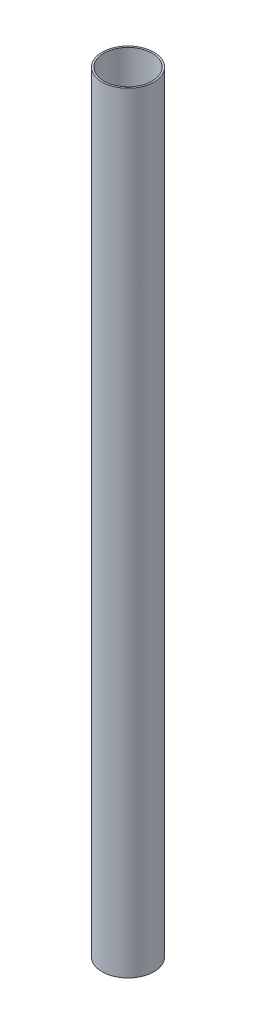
from build123d import *

# Parameters (mm, degrees)
BASE_EXTRUSION_DEPTH      = 870
BASE_EXTRUSION_DEPTH_BACK = 23
ESQUISSE1_R               = 30
ESQUISSE1_R_2             = 28
ENL_V_MAT_EXTRU_1_DEPTH   = 872.033868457
ESQUISSE3_R               = 5
ENL_V_MAT_EXTRU_4_DEPTH   = 872.033868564


with BuildPart() as part:
    # Esquisse1 → Base-Extrusion (new, two sides: drawn at the far end of the back side and taken through both)
    with BuildSketch(Plane(origin=(0, 0, 0), x_dir=(1, 0, 0), z_dir=(0, 1, 0)).offset(-BASE_EXTRUSION_DEPTH_BACK)):
        with Locations(Location((0, 0, 0), (0, 0, 90))):
            Circle(ESQUISSE1_R)
        with Locations(Location((0, 0, 0), (0, 0, 90))):
            Circle(ESQUISSE1_R_2, mode=Mode.SUBTRACT)
    extrude(amount=BASE_EXTRUSION_DEPTH + BASE_EXTRUSION_DEPTH_BACK)

    # Esquisse2 → Enl_v. mat.-Extru.1 (cut, through all)
    with BuildSketch(Plane(origin=(0, 0, 0), x_dir=(0, 0, -1), z_dir=(1, 0, 0))):
        with BuildLine():
            Line((-23, -30), (-23, 5))
            ThreePointArc((-23, 5), (0, 28), (23, 5))
            Line((23, 5), (23, -30))
            Line((23, -30), (-23, -30))
        make_face()
    extrude(amount=-ENL_V_MAT_EXTRU_1_DEPTH, mode=Mode.SUBTRACT)

    # Esquisse3 → Enl_v. mat.-Extru.4 (cut, through all)
    with BuildSketch(Plane(origin=(0, 0, 0), x_dir=(0, 0, -1), z_dir=(1, 0, 0))):
        with Locations((0, 47.5)):
            Circle(ESQUISSE3_R)
        with Locations((0, 107.5)):
            Circle(ESQUISSE3_R)
    extrude(amount=-ENL_V_MAT_EXTRU_4_DEPTH, mode=Mode.SUBTRACT)


solid = part.part
